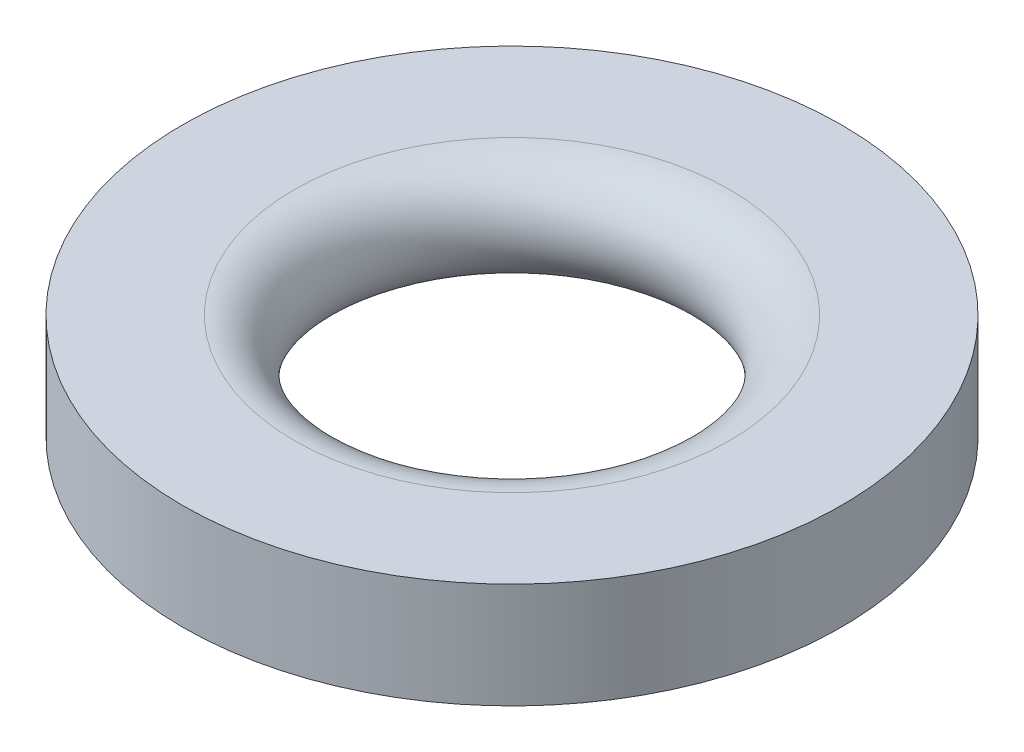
from build123d import *


with BuildPart() as part:
    # Sketch1 → Revolve1 (revolve)
    with BuildSketch(Plane(origin=(0, 0, 0), x_dir=(0, 0, -1), z_dir=(1, 0, 0)), mode=Mode.PRIVATE) as revolve1_sk:
        with BuildLine():
            Line((2.0955, 0.508), (3.175, 0.508))
            Line((3.175, 0.508), (3.175, -0.508))
            Line((3.175, -0.508), (2.0955, -0.508))
            ThreePointArc((2.0955, -0.508), (1.5875, 0), (2.0955, 0.508))
        make_face()
    revolve(revolve1_sk.sketch.rotate(Axis((0, 33.290903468, 0), (0, -1, 0)), 180), axis=Axis((0, 33.290903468, 0), (0, -1, 0)))


solid = part.part
